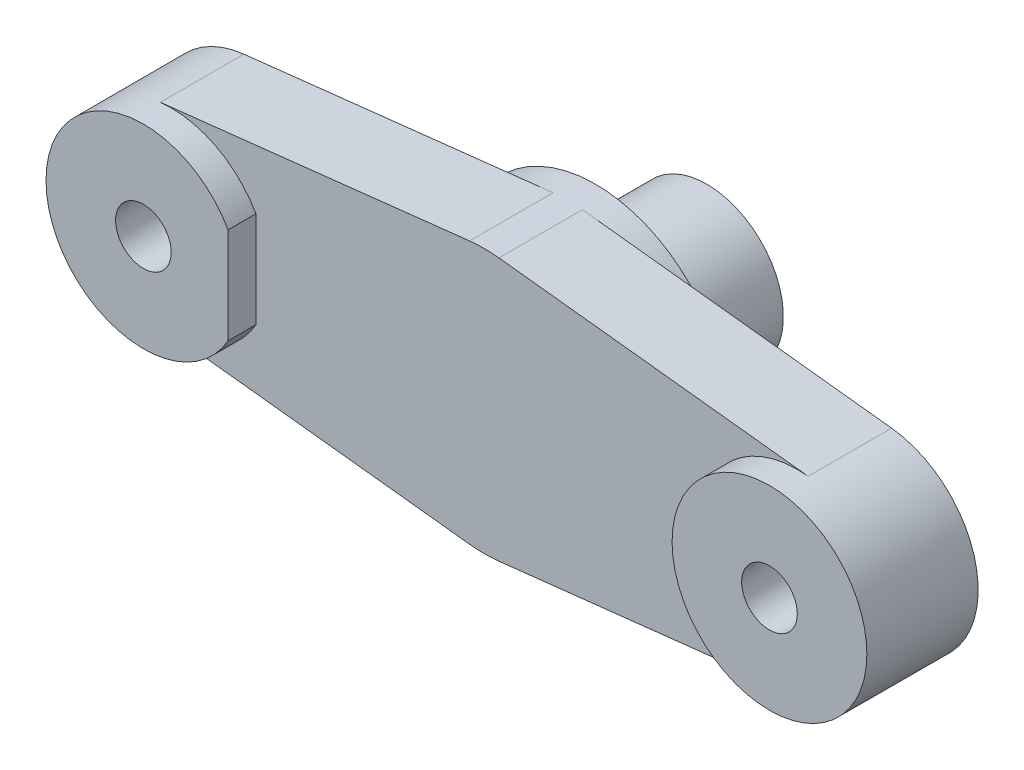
from build123d import *

# Parameters (mm, degrees)
BASE_EXTRUSION_DEPTH    = 12
ESQUISSE2_R             = 14
BOSS_EXTRU_1_DEPTH      = 4
BOSS_EXTRU_2_START      = 4
ESQUISSE3_R             = 19
BOSS_EXTRU_2_DEPTH      = 4
ESQUISSE4_R             = 11
BOSS_EXTRU_3_DEPTH      = 16
ESQUISSE5_R             = 4
ENL_V_MAT_EXTRU_1_DEPTH = 72.67984375
ESQUISSE6_R             = 7.5
ENL_V_MAT_EXTRU_2_DEPTH = 8


with BuildPart() as part:
    # Esquisse1 → Base-Extrusion (new body)
    with BuildSketch(Plane.XY):
        with BuildLine():
            Line((-46.555555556, 13.91331186), (-2.111111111, 18.88235181))
            ThreePointArc((-2.111111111, 18.88235181), (0, 19), (2.111111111, 18.88235181))
            Line((2.111111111, 18.88235181), (46.555555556, 13.91331186))
            ThreePointArc((46.555555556, 13.91331186), (59, 0), (46.555555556, -13.91331186))
            Line((46.555555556, -13.91331186), (2.111111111, -18.88235181))
            ThreePointArc((2.111111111, -18.88235181), (0, -19), (-2.111111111, -18.88235181))
            Line((-2.111111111, -18.88235181), (-46.555555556, -13.91331186))
            ThreePointArc((-46.555555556, -13.91331186), (-59, 0), (-46.555555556, 13.91331186))
        make_face()
    extrude(amount=BASE_EXTRUSION_DEPTH)

    # Esquisse2 → Boss.-Extru.1 (add)
    with BuildSketch(Plane.XY.offset(12)):
        with Locations(Location((45, 0, 0), (0, 0, 83.620629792))):
            Circle(ESQUISSE2_R)
        with BuildLine():
            Line((-32.820665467, 6.903898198), (-32.820665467, -6.903898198))
            ThreePointArc((-32.820665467, -6.903898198), (-59, 0), (-32.820665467, 6.903898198))
        make_face()
    extrude(amount=BOSS_EXTRU_1_DEPTH)

    # Esquisse3 → Boss.-Extru.2 (add)
    with BuildSketch(Plane(origin=(0, 0, 0), x_dir=(-1, 0, 0), z_dir=(0, 0, -1)).offset(BOSS_EXTRU_2_START)):
        Circle(ESQUISSE3_R)
    extrude(amount=-BOSS_EXTRU_2_DEPTH)

    # Esquisse4 → Boss.-Extru.3 (add)
    with BuildSketch(Plane(origin=(0, 0, -4), x_dir=(-1, 0, 0), z_dir=(0, 0, -1))):
        Circle(ESQUISSE4_R)
    extrude(amount=BOSS_EXTRU_3_DEPTH)

    # Esquisse5 → Enl_v. mat.-Extru.1 (cut, through all)
    with BuildSketch(Plane.XY.offset(16)):
        with Locations((-45, 0)):
            Circle(ESQUISSE5_R)
        with Locations((45, 0)):
            Circle(ESQUISSE5_R)
    extrude(amount=-ENL_V_MAT_EXTRU_1_DEPTH, mode=Mode.SUBTRACT)

    # Esquisse6 → Enl_v. mat.-Extru.2 (cut)
    with BuildSketch(Plane(origin=(0, 0, 0), x_dir=(-1, 0, 0), z_dir=(0, 0, -1))):
        with Locations((-45, 0)):
            Circle(ESQUISSE6_R)
        with Locations((45, 0)):
            Circle(ESQUISSE6_R)
    extrude(amount=-ENL_V_MAT_EXTRU_2_DEPTH, mode=Mode.SUBTRACT)


solid = part.part
